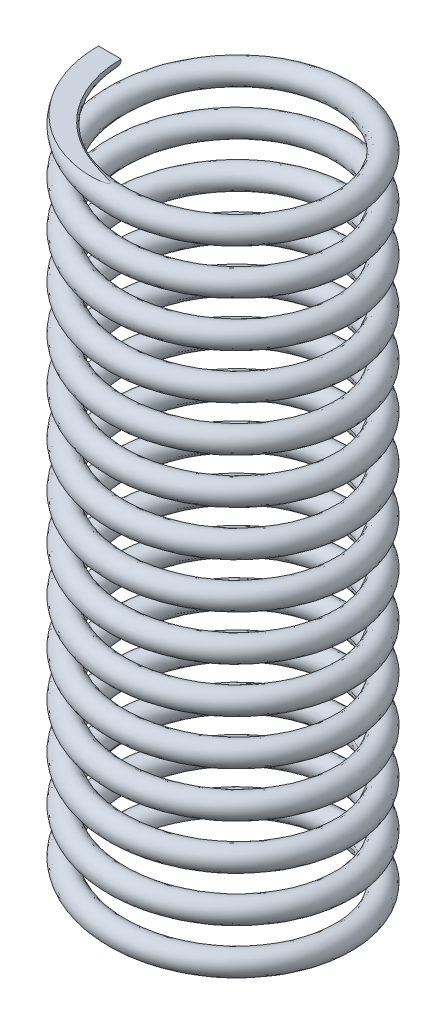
from build123d import *

# Parameters (mm, degrees)
SWEEP_1_PITCH            = 2
SWEEP_1_HEIGHT           = 30
SWEEP_1_RADIUS           = 5
SWEEP_1_START_ANGLE      = -90
SKETCH_2_R               = 0.5
CUT_EXTRUDE_1_DEPTH      = 10
CUT_EXTRUDE_1_DEPTH_BACK = 10


with BuildPart() as part:
    # Sweep 1: sweep along a helix
    with BuildLine() as sweep_1_path:
        add(Helix(SWEEP_1_PITCH, SWEEP_1_HEIGHT, SWEEP_1_RADIUS, center=(0, 0, 0), direction=(0, 1, 0), lefthand=True, mode=Mode.PRIVATE).rotate(Axis((0, 0, 0), (0, 1, 0)), SWEEP_1_START_ANGLE))
    # Sketch 2 → Sweep 1 (sweep)
    with BuildSketch(Plane.XY):
        with Locations((-5, 0)):
            Circle(SKETCH_2_R)
    sweep(path=sweep_1_path.line, is_frenet=True)

    # Sketch 3 → Cut-Extrude 1 (cut, two sides: drawn at the far end of the back side and taken through both)
    with BuildSketch(Plane.XY.offset(-CUT_EXTRUDE_1_DEPTH_BACK)):
        Polygon((9.914358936, 30), (0, 30), (-8.810873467, 30), (-4.572358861, 31.253277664), align=None)
        Polygon((-8.01381653, 0), (0, 0), (7.430832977, 0), (-8.01381653, -1.431638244), align=None)
    extrude(amount=CUT_EXTRUDE_1_DEPTH + CUT_EXTRUDE_1_DEPTH_BACK, mode=Mode.SUBTRACT)


solid = part.part
